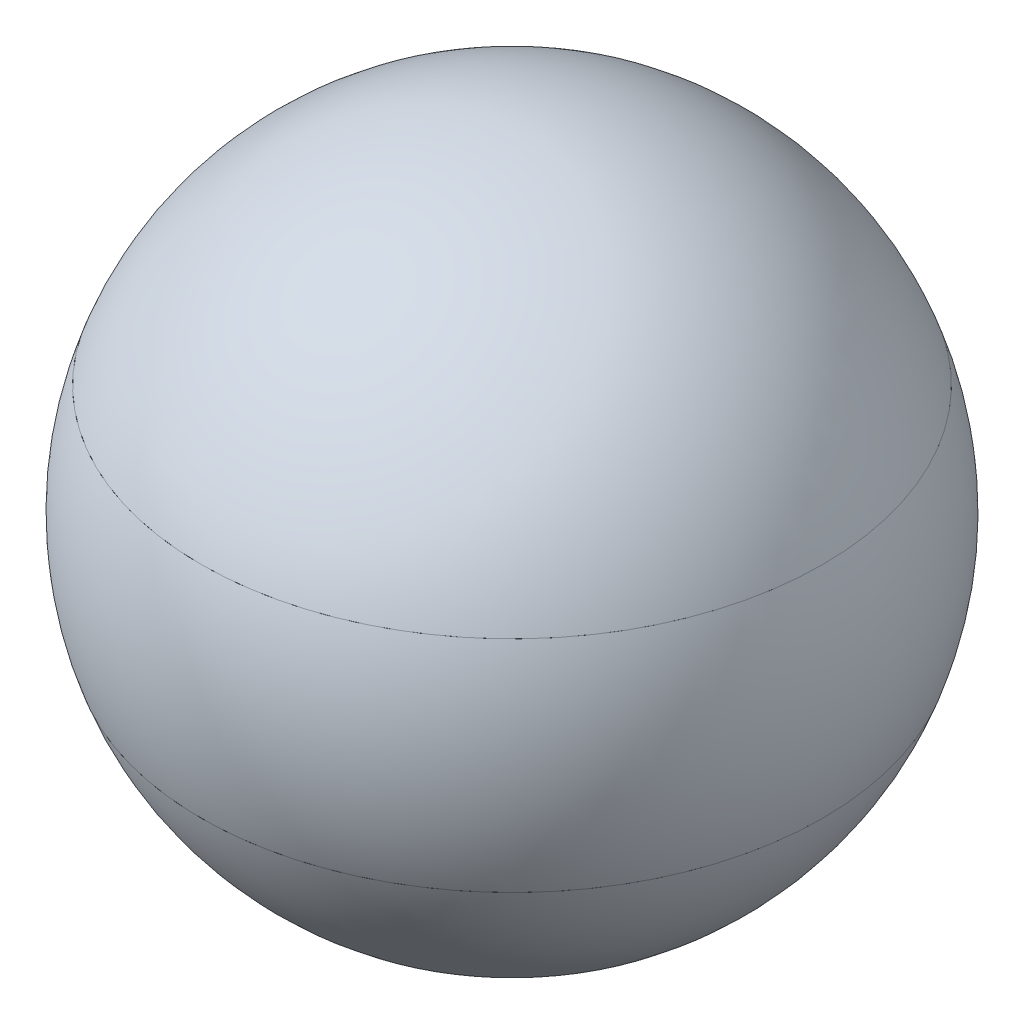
from build123d import *


with BuildPart() as part:
    # Skizze1 → Rotation1 (revolve)
    with BuildSketch(Plane.XY):
        with BuildLine():
            ThreePointArc((47.140452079, 16.666666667), (28.867513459, 40.824829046), (0, 50))
            Line((0, 50), (0, 16.666666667))
            Line((0, 16.666666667), (47.140452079, 16.666666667))
        make_face()
    revolve(axis=Axis((0, 69.593310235, 0), (0, -1, 0)))


with BuildPart() as body_2:
    # Skizze1_3 → Rotation2 (revolve)
    with BuildSketch(Plane.XY):
        with BuildLine():
            Line((47.140452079, 16.666666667), (0, 16.666666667))
            Line((0, 16.666666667), (0, -16.666666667))
            Line((0, -16.666666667), (47.140452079, -16.666666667))
            ThreePointArc((47.140452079, -16.666666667), (50, 0), (47.140452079, 16.666666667))
        make_face()
    revolve(axis=Axis((0, 69.593310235, 0), (0, -1, 0)))


with BuildPart() as body_3:
    # Skizze1_4 → Rotation3 (revolve)
    with BuildSketch(Plane.XY):
        with BuildLine():
            Line((47.140452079, -16.666666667), (0, -16.666666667))
            Line((0, -16.666666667), (0, -50))
            ThreePointArc((0, -50), (28.867513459, -40.824829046), (47.140452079, -16.666666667))
        make_face()
    revolve(axis=Axis((0, 69.593310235, 0), (0, -1, 0)))


solid = Compound([part.part, body_2.part, body_3.part])
